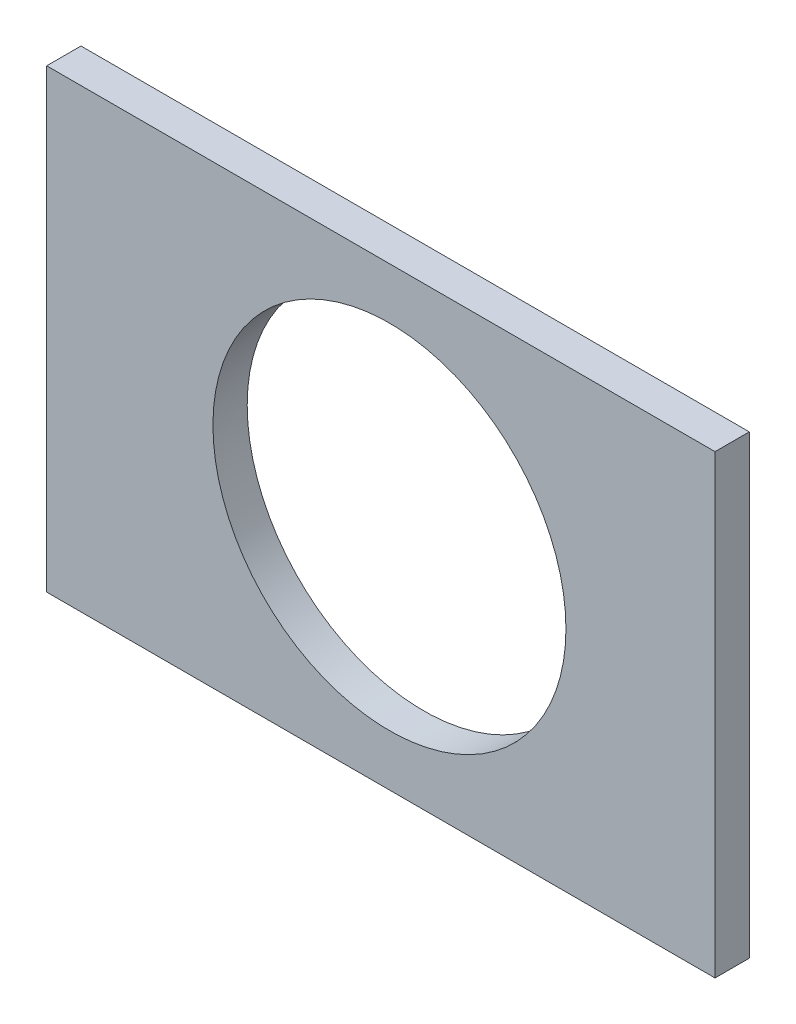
from build123d import *

# Parameters (mm, degrees)
ESQUISSE1_W             = 195
ESQUISSE1_H             = 133
EXTRUSION1_DEPTH        = 10
ENL_V_MAT_EXTRU_1_REACH = 238.25
ESQUISSE2_R             = 51.5


with BuildPart() as part:
    # Esquisse1 → Extrusion1 (new body)
    with BuildSketch(Plane.XY):
        with Locations((97.5, 66.5)):
            Rectangle(ESQUISSE1_W, ESQUISSE1_H)
    extrude(amount=EXTRUSION1_DEPTH)

    # Esquisse2 → Enl_v. mat.-Extru.1 (cut, up to next)
    with BuildSketch(Plane.XY.offset(10), mode=Mode.PRIVATE) as enl_v_mat_extru_1_sk1:
        with Locations((100, 66.5)):
            Circle(ESQUISSE2_R)
    enl_v_mat_extru_1_tool1 = extrude(enl_v_mat_extru_1_sk1.sketch, amount=-ENL_V_MAT_EXTRU_1_REACH, mode=Mode.PRIVATE) & part.part
    add(enl_v_mat_extru_1_tool1.solids().sort_by_distance((100, 66.5, 10))[0], mode=Mode.SUBTRACT)


solid = part.part
